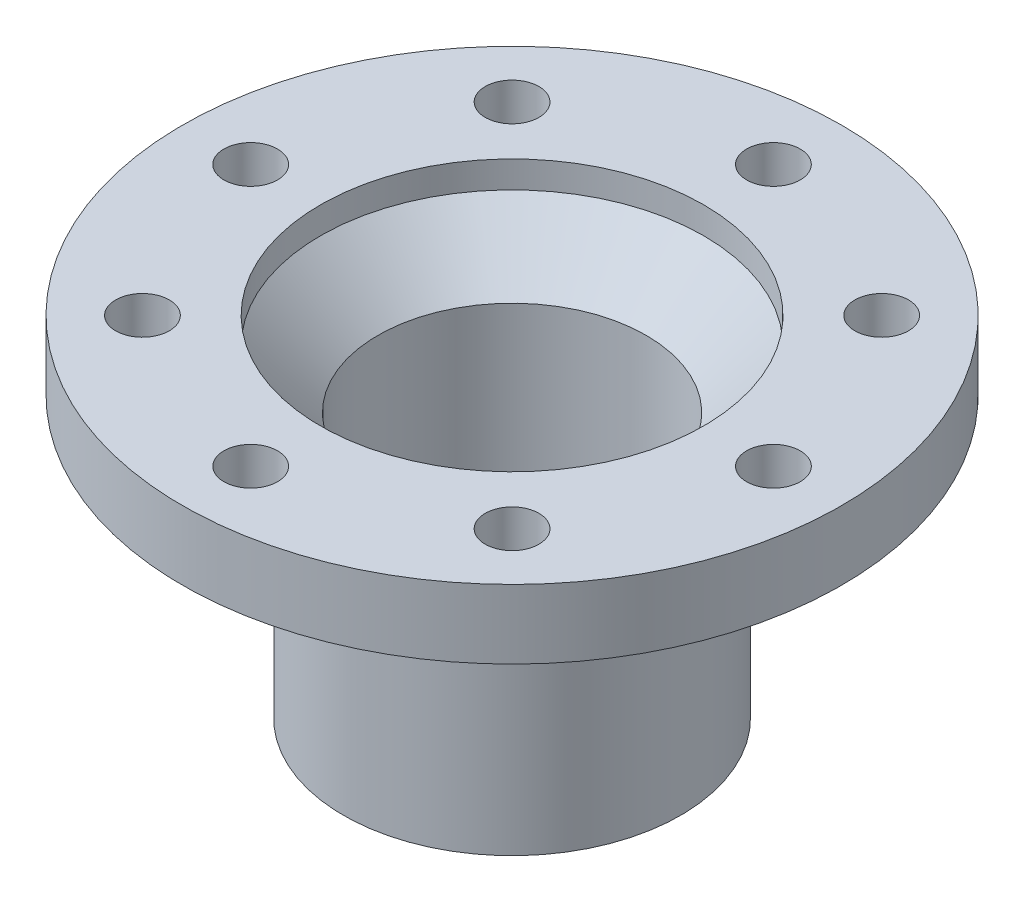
from build123d import *

# Parameters (mm, degrees)
CROQUIS2_R            = 3.5
CORTAR_EXTRUIR1_DEPTH = 10
MATRIZC1_COUNT        = 8


with BuildPart() as part:
    # Croquis1 → Revoluci_n1 (revolve)
    with BuildSketch(Plane.XY, mode=Mode.PRIVATE) as revoluci_n1_sk:
        Polygon((17.5, 22.982569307), (17.5, -11.517430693), (22, -11.517430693), (22, 21.982569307), (25, 24.982569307), (43, 24.982569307), (43, 33.982569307), (25, 33.982569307), (25, 30.482569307), align=None)
    revolve(revoluci_n1_sk.sketch.rotate(Axis((0, 0, 0), (0, 1, 0)), 90), axis=Axis((0, 0, 0), (0, 1, 0)))

    # Croquis2 → Cortar-Extruir1 (cut)
    with BuildSketch(Plane(origin=(0, 33.982569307, 0), x_dir=(1, 0, 0), z_dir=(0, 1, 0))):
        with Locations(Location((0, 34.1, 0), (0, 0, 270))):
            Circle(CROQUIS2_R)
    cortar_extruir1 = extrude(amount=-CORTAR_EXTRUIR1_DEPTH, mode=Mode.SUBTRACT)

    # MatrizC1: Cortar-Extruir1 ×8 about axis
    matrizc1_axis = Axis((0, 0, 0), (0, 1, 0))
    for i in range(1, MATRIZC1_COUNT):
        add(cortar_extruir1.rotate(matrizc1_axis, i * 360 / MATRIZC1_COUNT), mode=Mode.SUBTRACT)


solid = part.part
